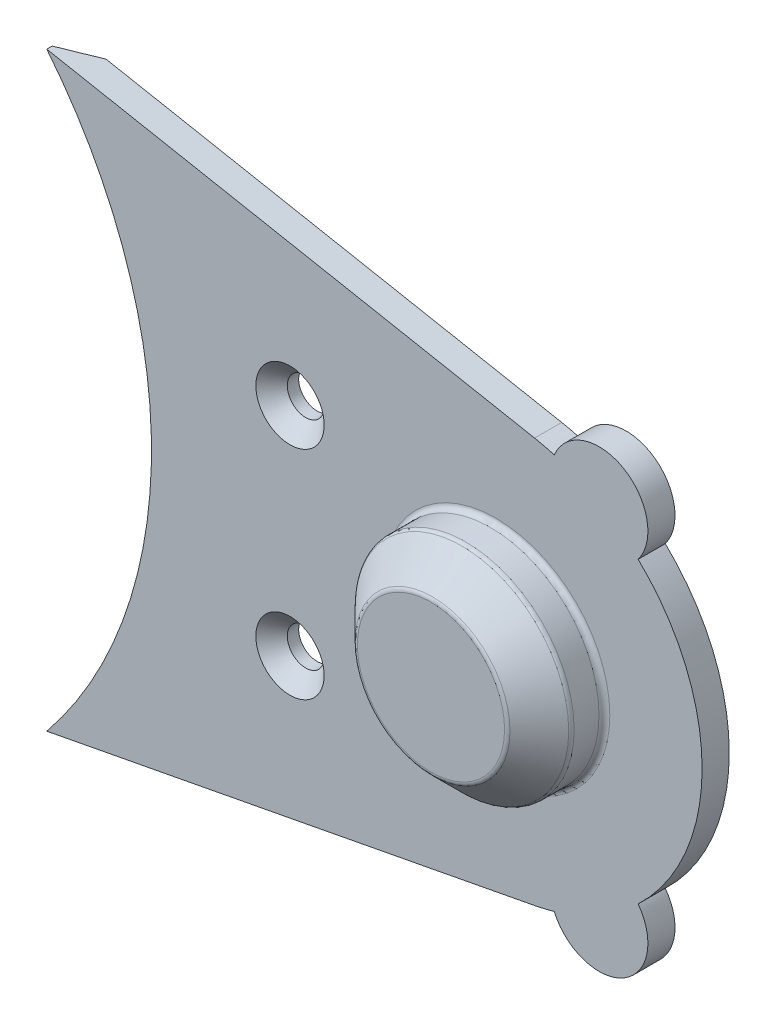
ISO-10303-21;
HEADER;
FILE_DESCRIPTION(('STEP AP214'),'2;1');
FILE_NAME('part.step','',(''),(''),'','','');
FILE_SCHEMA(('AUTOMOTIVE_DESIGN { 1 0 10303 214 1 1 1 1 }'));
ENDSEC;
DATA;
#1=APPLICATION_CONTEXT('core data for automotive mechanical design processes');
#2=APPLICATION_PROTOCOL_DEFINITION('international standard','automotive_design',2000,#1);
#3=PRODUCT_CONTEXT('',#1,'mechanical');
#4=PRODUCT('Part','Part','',(#3));
#5=PRODUCT_RELATED_PRODUCT_CATEGORY('part','',(#4));
#6=PRODUCT_DEFINITION_FORMATION('','',#4);
#7=PRODUCT_DEFINITION_CONTEXT('part definition',#1,'design');
#8=PRODUCT_DEFINITION('design','',#6,#7);
#9=PRODUCT_DEFINITION_SHAPE('','',#8);
#10=(LENGTH_UNIT() NAMED_UNIT(*) SI_UNIT(.MILLI.,.METRE.));
#11=(NAMED_UNIT(*) PLANE_ANGLE_UNIT() SI_UNIT($,.RADIAN.));
#12=(NAMED_UNIT(*) SI_UNIT($,.STERADIAN.) SOLID_ANGLE_UNIT());
#13=UNCERTAINTY_MEASURE_WITH_UNIT(LENGTH_MEASURE(1.E-05),#10,'distance_accuracy_value','');
#14=(GEOMETRIC_REPRESENTATION_CONTEXT(3) GLOBAL_UNCERTAINTY_ASSIGNED_CONTEXT((#13)) GLOBAL_UNIT_ASSIGNED_CONTEXT((#10,
#11,#12)) REPRESENTATION_CONTEXT('',''));
#15=CARTESIAN_POINT('',(0.,0.,0.));
#16=DIRECTION('',(0.,0.,1.));
#17=DIRECTION('',(1.,0.,0.));
#18=AXIS2_PLACEMENT_3D('',#15,#16,#17);
#19=CARTESIAN_POINT('',(75.,0.,2.5));
#20=DIRECTION('',(0.,0.,1.));
#21=DIRECTION('',(1.,0.,0.));
#22=AXIS2_PLACEMENT_3D('',#19,#20,#21);
#23=PLANE('',#22);
#24=CARTESIAN_POINT('',(75.,0.,2.5));
#25=DIRECTION('',(0.,0.,1.));
#26=DIRECTION('',(1.,0.,0.));
#27=AXIS2_PLACEMENT_3D('',#24,#25,#26);
#28=CIRCLE('',#27,10.4912212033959);
#29=CARTESIAN_POINT('',(85.4912212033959,0.,2.5));
#30=VERTEX_POINT('',#29);
#31=EDGE_CURVE('E161',#30,#30,#28,.F.);
#32=ORIENTED_EDGE('',*,*,#31,.T.);
#33=EDGE_LOOP('',(#32));
#34=FACE_BOUND('',#33,.T.);
#35=CARTESIAN_POINT('',(56.,-10.,2.5));
#36=DIRECTION('',(0.,0.,1.));
#37=DIRECTION('',(1.,0.,0.));
#38=AXIS2_PLACEMENT_3D('',#35,#36,#37);
#39=CIRCLE('',#38,3.15);
#40=CARTESIAN_POINT('',(59.15,-10.,2.5));
#41=VERTEX_POINT('',#40);
#42=EDGE_CURVE('E306',#41,#41,#39,.T.);
#43=ORIENTED_EDGE('',*,*,#42,.F.);
#44=EDGE_LOOP('',(#43));
#45=FACE_BOUND('',#44,.T.);
#46=CARTESIAN_POINT('',(56.,10.,2.5));
#47=DIRECTION('',(0.,0.,1.));
#48=DIRECTION('',(1.,0.,0.));
#49=AXIS2_PLACEMENT_3D('',#46,#47,#48);
#50=CIRCLE('',#49,3.15);
#51=CARTESIAN_POINT('',(59.15,10.,2.5));
#52=VERTEX_POINT('',#51);
#53=EDGE_CURVE('E286',#52,#52,#50,.T.);
#54=ORIENTED_EDGE('',*,*,#53,.F.);
#55=EDGE_LOOP('',(#54));
#56=FACE_BOUND('',#55,.T.);
#57=CARTESIAN_POINT('',(75.,0.,2.5));
#58=DIRECTION('',(0.,0.,1.));
#59=DIRECTION('',(1.,0.,0.));
#60=AXIS2_PLACEMENT_3D('',#57,#58,#59);
#61=CIRCLE('',#60,19.);
#62=CARTESIAN_POINT('',(80.3638604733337,18.2271501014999,2.5));
#63=VERTEX_POINT('',#62);
#64=CARTESIAN_POINT('',(78.55483641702,18.6644886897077,2.5));
#65=VERTEX_POINT('',#64);
#66=EDGE_CURVE('E116',#63,#65,#61,.T.);
#67=ORIENTED_EDGE('',*,*,#66,.T.);
#68=DIRECTION('',(-0.982341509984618,0.18709665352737,0.));
#69=VECTOR('',#68,1.);
#70=CARTESIAN_POINT('',(33.5734186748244,27.231644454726,2.5));
#71=LINE('',#70,#69);
#72=CARTESIAN_POINT('',(33.5734186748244,27.231644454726,2.5));
#73=VERTEX_POINT('',#72);
#74=EDGE_CURVE('E105',#65,#73,#71,.T.);
#75=ORIENTED_EDGE('',*,*,#74,.T.);
#76=CARTESIAN_POINT('',(0.,0.,2.5));
#77=DIRECTION('',(0.,0.,-1.));
#78=DIRECTION('',(1.,0.,0.));
#79=AXIS2_PLACEMENT_3D('',#76,#77,#78);
#80=CIRCLE('',#79,43.228889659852);
#81=CARTESIAN_POINT('',(33.5734186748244,-27.2316444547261,2.5));
#82=VERTEX_POINT('',#81);
#83=EDGE_CURVE('E115',#73,#82,#80,.T.);
#84=ORIENTED_EDGE('',*,*,#83,.T.);
#85=DIRECTION('',(0.982341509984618,0.187096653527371,0.));
#86=VECTOR('',#85,1.);
#87=CARTESIAN_POINT('',(33.5734186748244,-27.2316444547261,2.5));
#88=LINE('',#87,#86);
#89=CARTESIAN_POINT('',(78.55483641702,-18.6644886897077,2.5));
#90=VERTEX_POINT('',#89);
#91=EDGE_CURVE('E279',#82,#90,#88,.T.);
#92=ORIENTED_EDGE('',*,*,#91,.T.);
#93=CARTESIAN_POINT('',(75.,0.,2.5));
#94=DIRECTION('',(0.,0.,1.));
#95=DIRECTION('',(1.,0.,0.));
#96=AXIS2_PLACEMENT_3D('',#93,#94,#95);
#97=CIRCLE('',#96,19.);
#98=CARTESIAN_POINT('',(80.3638604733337,-18.2271501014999,2.5));
#99=VERTEX_POINT('',#98);
#100=EDGE_CURVE('E290',#90,#99,#97,.T.);
#101=ORIENTED_EDGE('',*,*,#100,.T.);
#102=CARTESIAN_POINT('',(84.5,-16.4544826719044,2.5));
#103=DIRECTION('',(0.,0.,1.));
#104=DIRECTION('',(1.,0.,0.));
#105=AXIS2_PLACEMENT_3D('',#102,#103,#104);
#106=CIRCLE('',#105,4.5);
#107=CARTESIAN_POINT('',(88.1032447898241,-13.7588144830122,2.5));
#108=VERTEX_POINT('',#107);
#109=EDGE_CURVE('E291',#99,#108,#106,.T.);
#110=ORIENTED_EDGE('',*,*,#109,.T.);
#111=CARTESIAN_POINT('',(75.,0.,2.5));
#112=DIRECTION('',(0.,0.,1.));
#113=DIRECTION('',(1.,0.,0.));
#114=AXIS2_PLACEMENT_3D('',#111,#112,#113);
#115=CIRCLE('',#114,19.);
#116=CARTESIAN_POINT('',(88.1032447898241,13.7588144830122,2.5));
#117=VERTEX_POINT('',#116);
#118=EDGE_CURVE('E262',#108,#117,#115,.T.);
#119=ORIENTED_EDGE('',*,*,#118,.T.);
#120=CARTESIAN_POINT('',(84.5,16.4544826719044,2.5));
#121=DIRECTION('',(0.,0.,1.));
#122=DIRECTION('',(1.,0.,0.));
#123=AXIS2_PLACEMENT_3D('',#120,#121,#122);
#124=CIRCLE('',#123,4.5);
#125=EDGE_CURVE('E120',#117,#63,#124,.T.);
#126=ORIENTED_EDGE('',*,*,#125,.T.);
#127=EDGE_LOOP('',(#67,#75,#84,#92,#101,#110,#119,#126));
#128=FACE_BOUND('',#127,.T.);
#129=ADVANCED_FACE('F31',(#34,#45,#56,#128),#23,.T.);
#130=CARTESIAN_POINT('',(75.,0.,2.5));
#131=DIRECTION('',(0.,0.,-1.));
#132=DIRECTION('',(-1.,0.,0.));
#133=AXIS2_PLACEMENT_3D('',#130,#131,#132);
#134=CYLINDRICAL_SURFACE('',#133,19.);
#135=CARTESIAN_POINT('',(75.,0.,0.));
#136=DIRECTION('',(0.,0.,1.));
#137=DIRECTION('',(1.,0.,0.));
#138=AXIS2_PLACEMENT_3D('',#135,#136,#137);
#139=CIRCLE('',#138,19.);
#140=CARTESIAN_POINT('',(80.3638604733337,18.2271501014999,0.));
#141=VERTEX_POINT('',#140);
#142=CARTESIAN_POINT('',(78.55483641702,18.6644886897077,0.));
#143=VERTEX_POINT('',#142);
#144=EDGE_CURVE('E128',#141,#143,#139,.T.);
#145=ORIENTED_EDGE('',*,*,#144,.T.);
#146=DIRECTION('',(0.,0.,-1.));
#147=VECTOR('',#146,1.);
#148=CARTESIAN_POINT('',(78.55483641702,18.6644886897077,2.5));
#149=LINE('',#148,#147);
#150=EDGE_CURVE('E109',#65,#143,#149,.T.);
#151=ORIENTED_EDGE('',*,*,#150,.F.);
#152=ORIENTED_EDGE('',*,*,#66,.F.);
#153=DIRECTION('',(0.,0.,-1.));
#154=VECTOR('',#153,1.);
#155=CARTESIAN_POINT('',(80.3638604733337,18.2271501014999,2.5));
#156=LINE('',#155,#154);
#157=EDGE_CURVE('E270',#63,#141,#156,.T.);
#158=ORIENTED_EDGE('',*,*,#157,.T.);
#159=EDGE_LOOP('',(#145,#151,#152,#158));
#160=FACE_BOUND('',#159,.T.);
#161=ADVANCED_FACE('F126',(#160),#134,.T.);
#162=CARTESIAN_POINT('',(33.5734186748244,27.231644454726,2.5));
#163=DIRECTION('',(-0.18709665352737,-0.982341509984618,0.));
#164=DIRECTION('',(0.982341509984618,-0.18709665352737,0.));
#165=AXIS2_PLACEMENT_3D('',#162,#163,#164);
#166=PLANE('',#165);
#167=DIRECTION('',(-0.982341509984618,0.18709665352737,0.));
#168=VECTOR('',#167,1.);
#169=CARTESIAN_POINT('',(33.5734186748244,27.231644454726,0.));
#170=LINE('',#169,#168);
#171=CARTESIAN_POINT('',(36.5300133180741,26.6685317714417,0.));
#172=VERTEX_POINT('',#171);
#173=EDGE_CURVE('E282',#143,#172,#170,.T.);
#174=ORIENTED_EDGE('',*,*,#173,.T.);
#175=CARTESIAN_POINT('',(36.5300133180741,26.6685317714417,0.));
#176=CARTESIAN_POINT('',(36.2857304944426,26.715057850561,0.169865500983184));
#177=CARTESIAN_POINT('',(36.0409476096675,26.7616791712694,0.338986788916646));
#178=CARTESIAN_POINT('',(35.5503533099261,26.8551177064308,0.675652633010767));
#179=CARTESIAN_POINT('',(35.3045419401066,26.9019349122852,0.843197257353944));
#180=CARTESIAN_POINT('',(34.8118403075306,26.9957748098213,1.17663674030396));
#181=CARTESIAN_POINT('',(34.5649500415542,27.0427975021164,1.34253159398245));
#182=CARTESIAN_POINT('',(34.0700395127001,27.1370581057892,1.67258911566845));
#183=CARTESIAN_POINT('',(33.8220192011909,27.1842960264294,1.83675170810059));
#184=CARTESIAN_POINT('',(33.5734186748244,27.231644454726,2.00000000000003));
#185=B_SPLINE_CURVE_WITH_KNOTS('',3,(#175,#176,#177,#178,#179,#180,#181,#182,#183,#184),
.UNSPECIFIED.,.F.,.F.,(4,2,2,2,4),(0.,0.903458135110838,1.80687701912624,2.71029860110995,
3.61375943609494),.UNSPECIFIED.);
#186=CARTESIAN_POINT('',(33.5734186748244,27.231644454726,2.00000000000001));
#187=VERTEX_POINT('',#186);
#188=EDGE_CURVE('E11',#172,#187,#185,.T.);
#189=ORIENTED_EDGE('',*,*,#188,.T.);
#190=DIRECTION('',(0.,0.,-1.));
#191=VECTOR('',#190,1.);
#192=CARTESIAN_POINT('',(33.5734186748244,27.231644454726,2.5));
#193=LINE('',#192,#191);
#194=EDGE_CURVE('E112',#73,#187,#193,.T.);
#195=ORIENTED_EDGE('',*,*,#194,.F.);
#196=ORIENTED_EDGE('',*,*,#74,.F.);
#197=ORIENTED_EDGE('',*,*,#150,.T.);
#198=EDGE_LOOP('',(#174,#189,#195,#196,#197));
#199=FACE_BOUND('',#198,.T.);
#200=ADVANCED_FACE('F107',(#199),#166,.F.);
#201=CARTESIAN_POINT('',(0.,0.,2.5));
#202=DIRECTION('',(0.,0.,-1.));
#203=DIRECTION('',(-1.,0.,0.));
#204=AXIS2_PLACEMENT_3D('',#201,#202,#203);
#205=CYLINDRICAL_SURFACE('',#204,43.228889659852);
#206=ORIENTED_EDGE('',*,*,#194,.T.);
#207=CARTESIAN_POINT('',(0.,0.,2.00000000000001));
#208=DIRECTION('',(0.,0.,1.));
#209=DIRECTION('',(1.,0.,0.));
#210=AXIS2_PLACEMENT_3D('',#207,#208,#209);
#211=CIRCLE('',#210,43.228889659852);
#212=CARTESIAN_POINT('',(33.5734186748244,-27.2316444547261,2.00000000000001));
#213=VERTEX_POINT('',#212);
#214=EDGE_CURVE('E164',#187,#213,#211,.F.);
#215=ORIENTED_EDGE('',*,*,#214,.T.);
#216=DIRECTION('',(0.,0.,-1.));
#217=VECTOR('',#216,1.);
#218=CARTESIAN_POINT('',(33.5734186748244,-27.2316444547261,2.5));
#219=LINE('',#218,#217);
#220=EDGE_CURVE('E134',#82,#213,#219,.T.);
#221=ORIENTED_EDGE('',*,*,#220,.F.);
#222=ORIENTED_EDGE('',*,*,#83,.F.);
#223=EDGE_LOOP('',(#206,#215,#221,#222));
#224=FACE_BOUND('',#223,.T.);
#225=ADVANCED_FACE('F177',(#224),#205,.F.);
#226=CARTESIAN_POINT('',(33.5734186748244,-27.2316444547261,2.5));
#227=DIRECTION('',(-0.187096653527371,0.982341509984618,0.));
#228=DIRECTION('',(-0.982341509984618,-0.187096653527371,0.));
#229=AXIS2_PLACEMENT_3D('',#226,#227,#228);
#230=PLANE('',#229);
#231=ORIENTED_EDGE('',*,*,#220,.T.);
#232=CARTESIAN_POINT('',(33.5734186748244,-27.2316444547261,2.00000000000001));
#233=CARTESIAN_POINT('',(33.8220192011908,-27.1842960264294,1.83675170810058));
#234=CARTESIAN_POINT('',(34.0700395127,-27.1370581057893,1.67258911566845));
#235=CARTESIAN_POINT('',(34.5649500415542,-27.0427975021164,1.34253159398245));
#236=CARTESIAN_POINT('',(34.8118403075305,-26.9957748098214,1.17663674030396));
#237=CARTESIAN_POINT('',(35.3045419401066,-26.9019349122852,0.843197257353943));
#238=CARTESIAN_POINT('',(35.5503533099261,-26.8551177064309,0.675652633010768));
#239=CARTESIAN_POINT('',(36.0409476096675,-26.7616791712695,0.338986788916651));
#240=CARTESIAN_POINT('',(36.2857304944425,-26.715057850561,0.169865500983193));
#241=CARTESIAN_POINT('',(36.5300133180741,-26.6685317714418,0.));
#242=B_SPLINE_CURVE_WITH_KNOTS('',3,(#232,#233,#234,#235,#236,#237,#238,#239,#240,#241),
.UNSPECIFIED.,.F.,.F.,(4,2,2,2,4),(0.,0.903460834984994,1.80688241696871,2.7103013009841,
3.61375943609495),.UNSPECIFIED.);
#243=CARTESIAN_POINT('',(36.5300133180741,-26.6685317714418,0.));
#244=VERTEX_POINT('',#243);
#245=EDGE_CURVE('E58',#213,#244,#242,.T.);
#246=ORIENTED_EDGE('',*,*,#245,.T.);
#247=DIRECTION('',(0.982341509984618,0.187096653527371,0.));
#248=VECTOR('',#247,1.);
#249=CARTESIAN_POINT('',(33.5734186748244,-27.2316444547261,0.));
#250=LINE('',#249,#248);
#251=CARTESIAN_POINT('',(78.55483641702,-18.6644886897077,0.));
#252=VERTEX_POINT('',#251);
#253=EDGE_CURVE('E283',#244,#252,#250,.T.);
#254=ORIENTED_EDGE('',*,*,#253,.T.);
#255=DIRECTION('',(0.,0.,-1.));
#256=VECTOR('',#255,1.);
#257=CARTESIAN_POINT('',(78.55483641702,-18.6644886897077,2.5));
#258=LINE('',#257,#256);
#259=EDGE_CURVE('E274',#90,#252,#258,.T.);
#260=ORIENTED_EDGE('',*,*,#259,.F.);
#261=ORIENTED_EDGE('',*,*,#91,.F.);
#262=EDGE_LOOP('',(#231,#246,#254,#260,#261));
#263=FACE_BOUND('',#262,.T.);
#264=ADVANCED_FACE('F171',(#263),#230,.F.);
#265=CARTESIAN_POINT('',(75.,0.,2.5));
#266=DIRECTION('',(0.,0.,-1.));
#267=DIRECTION('',(-1.,0.,0.));
#268=AXIS2_PLACEMENT_3D('',#265,#266,#267);
#269=CYLINDRICAL_SURFACE('',#268,19.);
#270=CARTESIAN_POINT('',(75.,0.,0.));
#271=DIRECTION('',(0.,0.,1.));
#272=DIRECTION('',(1.,0.,0.));
#273=AXIS2_PLACEMENT_3D('',#270,#271,#272);
#274=CIRCLE('',#273,19.);
#275=CARTESIAN_POINT('',(80.3638604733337,-18.2271501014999,0.));
#276=VERTEX_POINT('',#275);
#277=EDGE_CURVE('E258',#252,#276,#274,.T.);
#278=ORIENTED_EDGE('',*,*,#277,.T.);
#279=DIRECTION('',(0.,0.,-1.));
#280=VECTOR('',#279,1.);
#281=CARTESIAN_POINT('',(80.3638604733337,-18.2271501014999,2.5));
#282=LINE('',#281,#280);
#283=EDGE_CURVE('E254',#99,#276,#282,.T.);
#284=ORIENTED_EDGE('',*,*,#283,.F.);
#285=ORIENTED_EDGE('',*,*,#100,.F.);
#286=ORIENTED_EDGE('',*,*,#259,.T.);
#287=EDGE_LOOP('',(#278,#284,#285,#286));
#288=FACE_BOUND('',#287,.T.);
#289=ADVANCED_FACE('F176',(#288),#269,.T.);
#290=CARTESIAN_POINT('',(84.5,-16.4544826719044,2.5));
#291=DIRECTION('',(0.,0.,-1.));
#292=DIRECTION('',(-1.,0.,0.));
#293=AXIS2_PLACEMENT_3D('',#290,#291,#292);
#294=CYLINDRICAL_SURFACE('',#293,4.5);
#295=CARTESIAN_POINT('',(84.5,-16.4544826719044,0.));
#296=DIRECTION('',(0.,0.,1.));
#297=DIRECTION('',(1.,0.,0.));
#298=AXIS2_PLACEMENT_3D('',#295,#296,#297);
#299=CIRCLE('',#298,4.5);
#300=CARTESIAN_POINT('',(88.1032447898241,-13.7588144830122,0.));
#301=VERTEX_POINT('',#300);
#302=EDGE_CURVE('E248',#276,#301,#299,.T.);
#303=ORIENTED_EDGE('',*,*,#302,.T.);
#304=DIRECTION('',(0.,0.,-1.));
#305=VECTOR('',#304,1.);
#306=CARTESIAN_POINT('',(88.1032447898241,-13.7588144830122,2.5));
#307=LINE('',#306,#305);
#308=EDGE_CURVE('E251',#108,#301,#307,.T.);
#309=ORIENTED_EDGE('',*,*,#308,.F.);
#310=ORIENTED_EDGE('',*,*,#109,.F.);
#311=ORIENTED_EDGE('',*,*,#283,.T.);
#312=EDGE_LOOP('',(#303,#309,#310,#311));
#313=FACE_BOUND('',#312,.T.);
#314=ADVANCED_FACE('F237',(#313),#294,.T.);
#315=CARTESIAN_POINT('',(75.,0.,2.5));
#316=DIRECTION('',(0.,0.,-1.));
#317=DIRECTION('',(-1.,0.,0.));
#318=AXIS2_PLACEMENT_3D('',#315,#316,#317);
#319=CYLINDRICAL_SURFACE('',#318,19.);
#320=CARTESIAN_POINT('',(75.,0.,0.));
#321=DIRECTION('',(0.,0.,1.));
#322=DIRECTION('',(1.,0.,0.));
#323=AXIS2_PLACEMENT_3D('',#320,#321,#322);
#324=CIRCLE('',#323,19.);
#325=CARTESIAN_POINT('',(88.1032447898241,13.7588144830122,0.));
#326=VERTEX_POINT('',#325);
#327=EDGE_CURVE('E257',#301,#326,#324,.T.);
#328=ORIENTED_EDGE('',*,*,#327,.T.);
#329=DIRECTION('',(0.,0.,-1.));
#330=VECTOR('',#329,1.);
#331=CARTESIAN_POINT('',(88.1032447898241,13.7588144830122,2.5));
#332=LINE('',#331,#330);
#333=EDGE_CURVE('E263',#117,#326,#332,.T.);
#334=ORIENTED_EDGE('',*,*,#333,.F.);
#335=ORIENTED_EDGE('',*,*,#118,.F.);
#336=ORIENTED_EDGE('',*,*,#308,.T.);
#337=EDGE_LOOP('',(#328,#334,#335,#336));
#338=FACE_BOUND('',#337,.T.);
#339=ADVANCED_FACE('F234',(#338),#319,.T.);
#340=CARTESIAN_POINT('',(84.5,16.4544826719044,2.5));
#341=DIRECTION('',(0.,0.,-1.));
#342=DIRECTION('',(-1.,0.,0.));
#343=AXIS2_PLACEMENT_3D('',#340,#341,#342);
#344=CYLINDRICAL_SURFACE('',#343,4.5);
#345=CARTESIAN_POINT('',(84.5,16.4544826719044,0.));
#346=DIRECTION('',(0.,0.,1.));
#347=DIRECTION('',(1.,0.,0.));
#348=AXIS2_PLACEMENT_3D('',#345,#346,#347);
#349=CIRCLE('',#348,4.5);
#350=EDGE_CURVE('E124',#326,#141,#349,.T.);
#351=ORIENTED_EDGE('',*,*,#350,.T.);
#352=ORIENTED_EDGE('',*,*,#157,.F.);
#353=ORIENTED_EDGE('',*,*,#125,.F.);
#354=ORIENTED_EDGE('',*,*,#333,.T.);
#355=EDGE_LOOP('',(#351,#352,#353,#354));
#356=FACE_BOUND('',#355,.T.);
#357=ADVANCED_FACE('F230',(#356),#344,.T.);
#358=CARTESIAN_POINT('',(75.,0.,0.));
#359=DIRECTION('',(0.,0.,1.));
#360=DIRECTION('',(1.,0.,0.));
#361=AXIS2_PLACEMENT_3D('',#358,#359,#360);
#362=PLANE('',#361);
#363=CARTESIAN_POINT('',(75.,0.,0.));
#364=DIRECTION('',(0.,0.,1.));
#365=DIRECTION('',(1.,0.,0.));
#366=AXIS2_PLACEMENT_3D('',#363,#364,#365);
#367=CIRCLE('',#366,9.5);
#368=CARTESIAN_POINT('',(84.5,0.,0.));
#369=VERTEX_POINT('',#368);
#370=EDGE_CURVE('E140',#369,#369,#367,.T.);
#371=ORIENTED_EDGE('',*,*,#370,.T.);
#372=EDGE_LOOP('',(#371));
#373=FACE_BOUND('',#372,.T.);
#374=CARTESIAN_POINT('',(56.,-10.,0.));
#375=DIRECTION('',(0.,0.,1.));
#376=DIRECTION('',(1.,0.,0.));
#377=AXIS2_PLACEMENT_3D('',#374,#375,#376);
#378=CIRCLE('',#377,1.7);
#379=CARTESIAN_POINT('',(57.7,-10.,0.));
#380=VERTEX_POINT('',#379);
#381=EDGE_CURVE('E312',#380,#380,#378,.T.);
#382=ORIENTED_EDGE('',*,*,#381,.T.);
#383=EDGE_LOOP('',(#382));
#384=FACE_BOUND('',#383,.T.);
#385=CARTESIAN_POINT('',(56.,10.,0.));
#386=DIRECTION('',(0.,0.,1.));
#387=DIRECTION('',(1.,0.,0.));
#388=AXIS2_PLACEMENT_3D('',#385,#386,#387);
#389=CIRCLE('',#388,1.7);
#390=CARTESIAN_POINT('',(57.7,10.,0.));
#391=VERTEX_POINT('',#390);
#392=EDGE_CURVE('E303',#391,#391,#389,.T.);
#393=ORIENTED_EDGE('',*,*,#392,.T.);
#394=EDGE_LOOP('',(#393));
#395=FACE_BOUND('',#394,.T.);
#396=ORIENTED_EDGE('',*,*,#253,.F.);
#397=CARTESIAN_POINT('',(0.,0.,0.));
#398=DIRECTION('',(0.,0.,1.));
#399=DIRECTION('',(1.,0.,0.));
#400=AXIS2_PLACEMENT_3D('',#397,#398,#399);
#401=CIRCLE('',#400,45.228889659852);
#402=EDGE_CURVE('E44',#244,#172,#401,.T.);
#403=ORIENTED_EDGE('',*,*,#402,.T.);
#404=ORIENTED_EDGE('',*,*,#173,.F.);
#405=ORIENTED_EDGE('',*,*,#144,.F.);
#406=ORIENTED_EDGE('',*,*,#350,.F.);
#407=ORIENTED_EDGE('',*,*,#327,.F.);
#408=ORIENTED_EDGE('',*,*,#302,.F.);
#409=ORIENTED_EDGE('',*,*,#277,.F.);
#410=EDGE_LOOP('',(#396,#403,#404,#405,#406,#407,#408,#409));
#411=FACE_BOUND('',#410,.T.);
#412=ADVANCED_FACE('F227',(#373,#384,#395,#411),#362,.F.);
#413=CARTESIAN_POINT('',(75.,0.,8.5));
#414=DIRECTION('',(0.,0.,-1.));
#415=DIRECTION('',(-1.,0.,0.));
#416=AXIS2_PLACEMENT_3D('',#413,#414,#415);
#417=CYLINDRICAL_SURFACE('',#416,9.9912212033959);
#418=CARTESIAN_POINT('',(75.,0.,3.));
#419=DIRECTION('',(0.,0.,1.));
#420=DIRECTION('',(1.,0.,0.));
#421=AXIS2_PLACEMENT_3D('',#418,#419,#420);
#422=CIRCLE('',#421,9.9912212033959);
#423=CARTESIAN_POINT('',(84.9912212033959,0.,3.));
#424=VERTEX_POINT('',#423);
#425=EDGE_CURVE('E158',#424,#424,#422,.T.);
#426=ORIENTED_EDGE('',*,*,#425,.T.);
#427=EDGE_LOOP('',(#426));
#428=FACE_BOUND('',#427,.T.);
#429=CARTESIAN_POINT('',(75.,0.,5.29289321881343));
#430=DIRECTION('',(0.,0.,1.));
#431=DIRECTION('',(1.,0.,0.));
#432=AXIS2_PLACEMENT_3D('',#429,#430,#431);
#433=CIRCLE('',#432,9.9912212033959);
#434=CARTESIAN_POINT('',(84.9912212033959,0.,5.29289321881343));
#435=VERTEX_POINT('',#434);
#436=EDGE_CURVE('E155',#435,#435,#433,.F.);
#437=ORIENTED_EDGE('',*,*,#436,.T.);
#438=EDGE_LOOP('',(#437));
#439=FACE_BOUND('',#438,.T.);
#440=ADVANCED_FACE('F225',(#428,#439),#417,.T.);
#441=CARTESIAN_POINT('',(75.,0.,8.5));
#442=DIRECTION('',(0.,0.,1.));
#443=DIRECTION('',(1.,0.,0.));
#444=AXIS2_PLACEMENT_3D('',#441,#442,#443);
#445=PLANE('',#444);
#446=CARTESIAN_POINT('',(75.,0.,8.5));
#447=DIRECTION('',(0.,0.,1.));
#448=DIRECTION('',(1.,0.,0.));
#449=AXIS2_PLACEMENT_3D('',#446,#447,#448);
#450=CIRCLE('',#449,6.78411442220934);
#451=CARTESIAN_POINT('',(81.7841144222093,0.,8.5));
#452=VERTEX_POINT('',#451);
#453=EDGE_CURVE('E146',#452,#452,#450,.T.);
#454=ORIENTED_EDGE('',*,*,#453,.T.);
#455=EDGE_LOOP('',(#454));
#456=FACE_BOUND('',#455,.T.);
#457=ADVANCED_FACE('F190',(#456),#445,.T.);
#458=CARTESIAN_POINT('',(75.,0.,8.5));
#459=DIRECTION('',(0.,0.,-1.));
#460=DIRECTION('',(-1.,0.,0.));
#461=AXIS2_PLACEMENT_3D('',#458,#459,#460);
#462=CONICAL_SURFACE('',#461,6.99122120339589,0.785398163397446);
#463=CARTESIAN_POINT('',(75.,0.,8.35355339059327));
#464=DIRECTION('',(0.,0.,1.));
#465=DIRECTION('',(1.,0.,0.));
#466=AXIS2_PLACEMENT_3D('',#463,#464,#465);
#467=CIRCLE('',#466,7.13766781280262);
#468=CARTESIAN_POINT('',(82.1376678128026,0.,8.35355339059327));
#469=VERTEX_POINT('',#468);
#470=EDGE_CURVE('E152',#469,#469,#467,.F.);
#471=ORIENTED_EDGE('',*,*,#470,.T.);
#472=EDGE_LOOP('',(#471));
#473=FACE_BOUND('',#472,.T.);
#474=CARTESIAN_POINT('',(75.,0.,5.6464466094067));
#475=DIRECTION('',(0.,0.,-1.));
#476=DIRECTION('',(-1.,0.,0.));
#477=AXIS2_PLACEMENT_3D('',#474,#475,#476);
#478=CIRCLE('',#477,9.84477459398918);
#479=CARTESIAN_POINT('',(65.1552254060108,0.,5.6464466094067));
#480=VERTEX_POINT('',#479);
#481=EDGE_CURVE('E149',#480,#480,#478,.F.);
#482=ORIENTED_EDGE('',*,*,#481,.T.);
#483=EDGE_LOOP('',(#482));
#484=FACE_BOUND('',#483,.T.);
#485=ADVANCED_FACE('F186',(#473,#484),#462,.T.);
#486=CARTESIAN_POINT('',(56.,10.,2.5));
#487=DIRECTION('',(0.,0.,1.));
#488=DIRECTION('',(1.,0.,0.));
#489=AXIS2_PLACEMENT_3D('',#486,#487,#488);
#490=CONICAL_SURFACE('',#489,3.15,0.785398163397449);
#491=CARTESIAN_POINT('',(56.,10.,1.05));
#492=DIRECTION('',(0.,0.,1.));
#493=DIRECTION('',(1.,0.,0.));
#494=AXIS2_PLACEMENT_3D('',#491,#492,#493);
#495=CIRCLE('',#494,1.7);
#496=CARTESIAN_POINT('',(57.7,10.,1.05));
#497=VERTEX_POINT('',#496);
#498=EDGE_CURVE('E300',#497,#497,#495,.T.);
#499=ORIENTED_EDGE('',*,*,#498,.F.);
#500=EDGE_LOOP('',(#499));
#501=FACE_BOUND('',#500,.T.);
#502=ORIENTED_EDGE('',*,*,#53,.T.);
#503=EDGE_LOOP('',(#502));
#504=FACE_BOUND('',#503,.T.);
#505=ADVANCED_FACE('F189',(#501,#504),#490,.F.);
#506=CARTESIAN_POINT('',(56.,10.,2.5));
#507=DIRECTION('',(0.,0.,1.));
#508=DIRECTION('',(1.,0.,0.));
#509=AXIS2_PLACEMENT_3D('',#506,#507,#508);
#510=CYLINDRICAL_SURFACE('',#509,1.7);
#511=ORIENTED_EDGE('',*,*,#392,.F.);
#512=EDGE_LOOP('',(#511));
#513=FACE_BOUND('',#512,.T.);
#514=ORIENTED_EDGE('',*,*,#498,.T.);
#515=EDGE_LOOP('',(#514));
#516=FACE_BOUND('',#515,.T.);
#517=ADVANCED_FACE('F328',(#513,#516),#510,.F.);
#518=CARTESIAN_POINT('',(56.,-10.,2.5));
#519=DIRECTION('',(0.,0.,1.));
#520=DIRECTION('',(1.,0.,0.));
#521=AXIS2_PLACEMENT_3D('',#518,#519,#520);
#522=CONICAL_SURFACE('',#521,3.15,0.785398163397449);
#523=CARTESIAN_POINT('',(56.,-10.,1.05));
#524=DIRECTION('',(0.,0.,1.));
#525=DIRECTION('',(1.,0.,0.));
#526=AXIS2_PLACEMENT_3D('',#523,#524,#525);
#527=CIRCLE('',#526,1.7);
#528=CARTESIAN_POINT('',(57.7,-10.,1.05));
#529=VERTEX_POINT('',#528);
#530=EDGE_CURVE('E309',#529,#529,#527,.T.);
#531=ORIENTED_EDGE('',*,*,#530,.F.);
#532=EDGE_LOOP('',(#531));
#533=FACE_BOUND('',#532,.T.);
#534=ORIENTED_EDGE('',*,*,#42,.T.);
#535=EDGE_LOOP('',(#534));
#536=FACE_BOUND('',#535,.T.);
#537=ADVANCED_FACE('F322',(#533,#536),#522,.F.);
#538=CARTESIAN_POINT('',(56.,-10.,2.5));
#539=DIRECTION('',(0.,0.,1.));
#540=DIRECTION('',(1.,0.,0.));
#541=AXIS2_PLACEMENT_3D('',#538,#539,#540);
#542=CYLINDRICAL_SURFACE('',#541,1.7);
#543=ORIENTED_EDGE('',*,*,#381,.F.);
#544=EDGE_LOOP('',(#543));
#545=FACE_BOUND('',#544,.T.);
#546=ORIENTED_EDGE('',*,*,#530,.T.);
#547=EDGE_LOOP('',(#546));
#548=FACE_BOUND('',#547,.T.);
#549=ADVANCED_FACE('F318',(#545,#548),#542,.F.);
#550=CARTESIAN_POINT('',(75.,0.,5.));
#551=DIRECTION('',(0.,0.,-1.));
#552=DIRECTION('',(-1.,0.,0.));
#553=AXIS2_PLACEMENT_3D('',#550,#551,#552);
#554=CYLINDRICAL_SURFACE('',#553,9.);
#555=CARTESIAN_POINT('',(75.,0.,0.5));
#556=DIRECTION('',(0.,0.,1.));
#557=DIRECTION('',(1.,0.,0.));
#558=AXIS2_PLACEMENT_3D('',#555,#556,#557);
#559=CIRCLE('',#558,9.);
#560=CARTESIAN_POINT('',(84.,0.,0.5));
#561=VERTEX_POINT('',#560);
#562=EDGE_CURVE('E132',#561,#561,#559,.F.);
#563=ORIENTED_EDGE('',*,*,#562,.T.);
#564=EDGE_LOOP('',(#563));
#565=FACE_BOUND('',#564,.T.);
#566=CARTESIAN_POINT('',(75.,0.,4.5));
#567=DIRECTION('',(0.,0.,-1.));
#568=DIRECTION('',(-1.,0.,0.));
#569=AXIS2_PLACEMENT_3D('',#566,#567,#568);
#570=CIRCLE('',#569,9.);
#571=CARTESIAN_POINT('',(66.,0.,4.5));
#572=VERTEX_POINT('',#571);
#573=EDGE_CURVE('E129',#572,#572,#570,.F.);
#574=ORIENTED_EDGE('',*,*,#573,.T.);
#575=EDGE_LOOP('',(#574));
#576=FACE_BOUND('',#575,.T.);
#577=ADVANCED_FACE('F321',(#565,#576),#554,.F.);
#578=CARTESIAN_POINT('',(75.,0.,5.));
#579=DIRECTION('',(0.,0.,-1.));
#580=DIRECTION('',(-1.,0.,0.));
#581=AXIS2_PLACEMENT_3D('',#578,#579,#580);
#582=PLANE('',#581);
#583=CARTESIAN_POINT('',(75.,0.,5.));
#584=DIRECTION('',(0.,0.,-1.));
#585=DIRECTION('',(-1.,0.,0.));
#586=AXIS2_PLACEMENT_3D('',#583,#584,#585);
#587=CIRCLE('',#586,8.49999999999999);
#588=CARTESIAN_POINT('',(66.5,0.,5.));
#589=VERTEX_POINT('',#588);
#590=EDGE_CURVE('E143',#589,#589,#587,.T.);
#591=ORIENTED_EDGE('',*,*,#590,.T.);
#592=EDGE_LOOP('',(#591));
#593=FACE_BOUND('',#592,.T.);
#594=ADVANCED_FACE('F196',(#593),#582,.T.);
#595=CARTESIAN_POINT('',(75.,0.,0.5));
#596=DIRECTION('',(0.,0.,1.));
#597=DIRECTION('',(1.,0.,0.));
#598=AXIS2_PLACEMENT_3D('',#595,#596,#597);
#599=TOROIDAL_SURFACE('',#598,9.5,0.5);
#600=ORIENTED_EDGE('',*,*,#370,.F.);
#601=EDGE_LOOP('',(#600));
#602=FACE_BOUND('',#601,.T.);
#603=ORIENTED_EDGE('',*,*,#562,.F.);
#604=EDGE_LOOP('',(#603));
#605=FACE_BOUND('',#604,.T.);
#606=ADVANCED_FACE('F192',(#602,#605),#599,.T.);
#607=CARTESIAN_POINT('',(75.,0.,4.5));
#608=DIRECTION('',(0.,0.,-1.));
#609=DIRECTION('',(-1.,0.,0.));
#610=AXIS2_PLACEMENT_3D('',#607,#608,#609);
#611=TOROIDAL_SURFACE('',#610,8.49999999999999,0.5);
#612=ORIENTED_EDGE('',*,*,#573,.F.);
#613=EDGE_LOOP('',(#612));
#614=FACE_BOUND('',#613,.T.);
#615=ORIENTED_EDGE('',*,*,#590,.F.);
#616=EDGE_LOOP('',(#615));
#617=FACE_BOUND('',#616,.T.);
#618=ADVANCED_FACE('F195',(#614,#617),#611,.F.);
#619=CARTESIAN_POINT('',(75.,0.,8.));
#620=DIRECTION('',(0.,0.,1.));
#621=DIRECTION('',(1.,0.,0.));
#622=AXIS2_PLACEMENT_3D('',#619,#620,#621);
#623=TOROIDAL_SURFACE('',#622,6.78411442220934,0.5);
#624=ORIENTED_EDGE('',*,*,#470,.F.);
#625=EDGE_LOOP('',(#624));
#626=FACE_BOUND('',#625,.T.);
#627=ORIENTED_EDGE('',*,*,#453,.F.);
#628=EDGE_LOOP('',(#627));
#629=FACE_BOUND('',#628,.T.);
#630=ADVANCED_FACE('F200',(#626,#629),#623,.T.);
#631=CARTESIAN_POINT('',(75.,0.,3.));
#632=DIRECTION('',(0.,0.,1.));
#633=DIRECTION('',(1.,0.,0.));
#634=AXIS2_PLACEMENT_3D('',#631,#632,#633);
#635=TOROIDAL_SURFACE('',#634,10.4912212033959,0.5);
#636=ORIENTED_EDGE('',*,*,#31,.F.);
#637=EDGE_LOOP('',(#636));
#638=FACE_BOUND('',#637,.T.);
#639=ORIENTED_EDGE('',*,*,#425,.F.);
#640=EDGE_LOOP('',(#639));
#641=FACE_BOUND('',#640,.T.);
#642=ADVANCED_FACE('F204',(#638,#641),#635,.F.);
#643=CARTESIAN_POINT('',(75.,0.,5.29289321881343));
#644=DIRECTION('',(0.,0.,1.));
#645=DIRECTION('',(1.,0.,0.));
#646=AXIS2_PLACEMENT_3D('',#643,#644,#645);
#647=TOROIDAL_SURFACE('',#646,9.49122120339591,0.5);
#648=ORIENTED_EDGE('',*,*,#481,.F.);
#649=EDGE_LOOP('',(#648));
#650=FACE_BOUND('',#649,.T.);
#651=ORIENTED_EDGE('',*,*,#436,.F.);
#652=EDGE_LOOP('',(#651));
#653=FACE_BOUND('',#652,.T.);
#654=ADVANCED_FACE('F207',(#650,#653),#647,.T.);
#655=CARTESIAN_POINT('',(0.,0.,2.00000000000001));
#656=DIRECTION('',(0.,0.,-1.));
#657=DIRECTION('',(-1.,0.,0.));
#658=AXIS2_PLACEMENT_3D('',#655,#656,#657);
#659=CONICAL_SURFACE('',#658,43.228889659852,0.785398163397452);
#660=ORIENTED_EDGE('',*,*,#188,.F.);
#661=ORIENTED_EDGE('',*,*,#402,.F.);
#662=ORIENTED_EDGE('',*,*,#245,.F.);
#663=ORIENTED_EDGE('',*,*,#214,.F.);
#664=EDGE_LOOP('',(#660,#661,#662,#663));
#665=FACE_BOUND('',#664,.T.);
#666=ADVANCED_FACE('F33',(#665),#659,.F.);
#667=CLOSED_SHELL('',(#129,#161,#200,#225,#264,#289,#314,#339,#357,#412,#440,#457,#485,#505,
#517,#537,#549,#577,#594,#606,#618,#630,#642,#654,#666));
#668=MANIFOLD_SOLID_BREP('B2',#667);
#669=ADVANCED_BREP_SHAPE_REPRESENTATION('',(#18,#668),#14);
#670=SHAPE_DEFINITION_REPRESENTATION(#9,#669);
ENDSEC;
END-ISO-10303-21;
